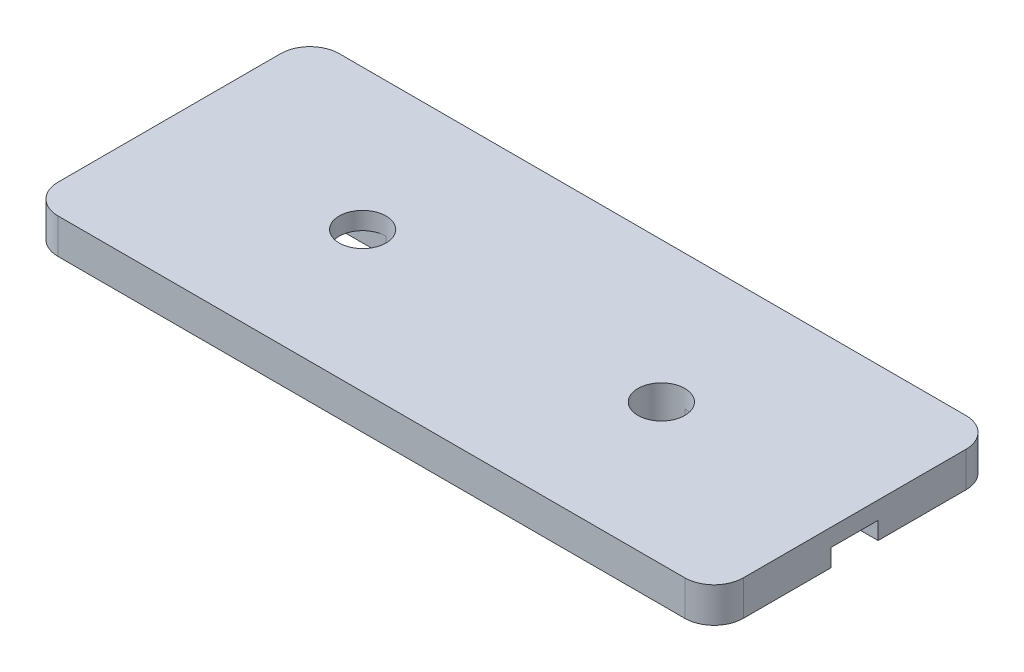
from build123d import *

# Parameters (mm, degrees)
ESBO_O1_W            = 11.7
ESBO_O1_H            = 4.8
EXTRUS_O1_DEPTH      = 0.6
FILETE1_R            = 0.5
ESBO_O2_R            = 0.4
EXTRUS_O2_DEPTH      = 7.351574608
EXTRUS_O3_REACH      = 13.959
EXTRUS_O3_END_RADIUS = 0.4
ESBO_O3_W            = 0.8
ESBO_O3_H            = 0.3
EXTRUS_O4_REACH      = 13.959
EXTRUS_O4_END_RADIUS = 0.4
ESBO_O4_W            = 0.8
ESBO_O4_H            = 0.3


with BuildPart() as part:
    # Esbo_o1 → Extrus_o1 (new body)
    with BuildSketch(Plane(origin=(0, 0, 0), x_dir=(1, 0, 0), z_dir=(0, 1, 0))):
        Rectangle(ESBO_O1_W, ESBO_O1_H)
    extrude(amount=EXTRUS_O1_DEPTH)

    # Filete1
    filete1_edges = [part.edges().sort_by_distance(p)[0] for p in [
        (-5.85, 0.3, -2.4),
        (5.85, 0.3, -2.4),
        (5.85, 0.3, 2.4),
        (-5.85, 0.3, 2.4),
    ]]
    fillet(filete1_edges, radius=FILETE1_R)

    # Esbo_o2 → Extrus_o2 (cut, through all)
    with BuildSketch(Plane(origin=(0, 0.6, 0), x_dir=(1, 0, 0), z_dir=(0, 1, 0))):
        with Locations(Location((-2.55, 0, 0), (0, 0, 270))):
            Circle(ESBO_O2_R)
        with Locations(Location((2.55, 0, 0), (0, 0, 270))):
            Circle(ESBO_O2_R)
    extrude(amount=-EXTRUS_O2_DEPTH, mode=Mode.SUBTRACT)

    # Extrus_o3: up to this cylinder (the profile starts outside it)
    extrus_o3_end = Plane(origin=(-2.55, 0.15, 0), z_dir=(0, 1, 0)) * Cylinder(EXTRUS_O3_END_RADIUS, 29.718, mode=Mode.PRIVATE)
    # Esbo_o3 → Extrus_o3 (cut, up to the surface)
    with BuildSketch(Plane.ZY.offset(5.85), mode=Mode.PRIVATE) as extrus_o3_sk1:
        with Locations((0, 0.15)):
            Rectangle(ESBO_O3_W, ESBO_O3_H)
    extrus_o3_tool1 = extrude(extrus_o3_sk1.sketch, amount=-EXTRUS_O3_REACH, mode=Mode.PRIVATE) - extrus_o3_end
    add(extrus_o3_tool1.solids().sort_by_distance((-5.85, 0.15, 0))[0], mode=Mode.SUBTRACT)

    # Extrus_o4: up to this cylinder (the profile starts outside it)
    extrus_o4_end = Plane(origin=(2.55, 0.15, 0), z_dir=(0, 1, 0)) * Cylinder(EXTRUS_O4_END_RADIUS, 29.718, mode=Mode.PRIVATE)
    # Esbo_o4 → Extrus_o4 (cut, up to the surface)
    with BuildSketch(Plane(origin=(5.85, 0, 0), x_dir=(0, 0, -1), z_dir=(1, 0, 0)), mode=Mode.PRIVATE) as extrus_o4_sk1:
        with Locations((0, 0.15)):
            Rectangle(ESBO_O4_W, ESBO_O4_H)
    extrus_o4_tool1 = extrude(extrus_o4_sk1.sketch, amount=-EXTRUS_O4_REACH, mode=Mode.PRIVATE) - extrus_o4_end
    add(extrus_o4_tool1.solids().sort_by_distance((5.85, 0.15, 0))[0], mode=Mode.SUBTRACT)


solid = part.part
